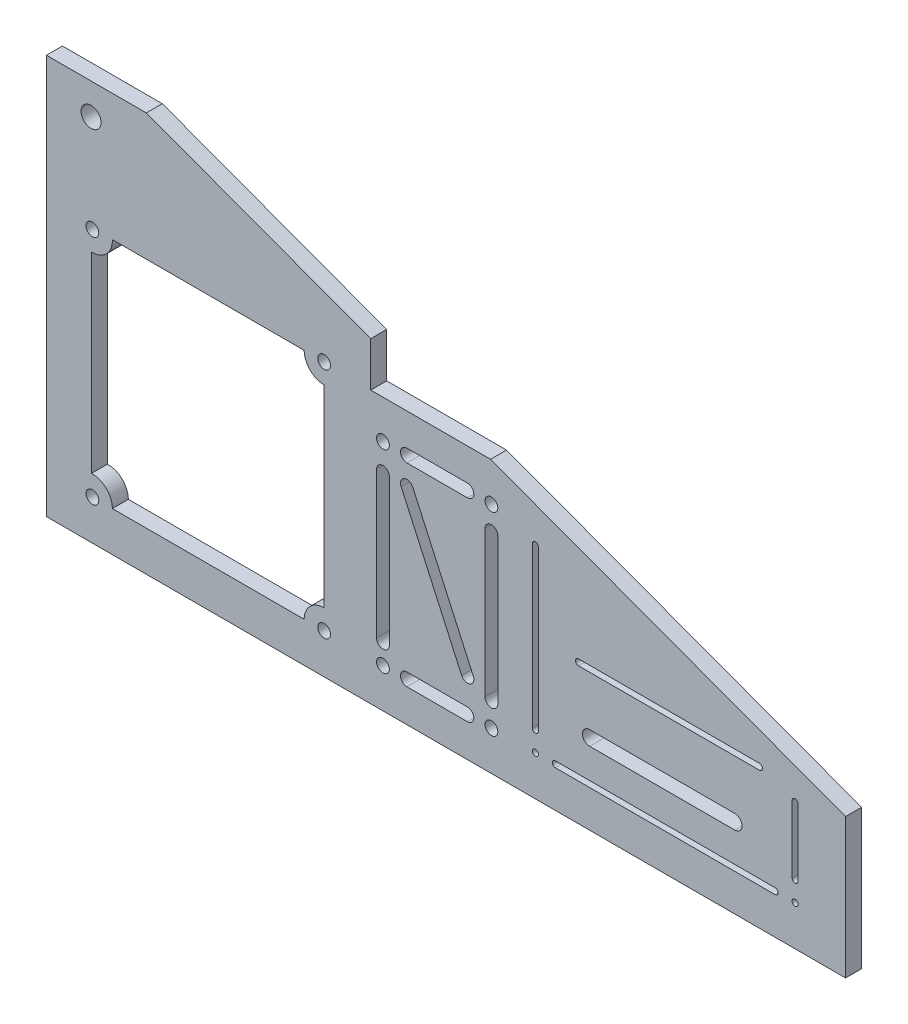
from build123d import *

# Parameters (mm, degrees)
SKETCH2_R           = 1.6
SKETCH2_R_2         = 0.75
SKETCH2_R_3         = 2.5
BOSS_EXTRUDE1_DEPTH = 4


with BuildPart() as part:
    # Sketch2 → Boss-Extrude1 (new body)
    with BuildSketch(Plane.XY):
        Polygon((0, 0), (0, 73.482722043), (0, 100), (25, 100), (81.153846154, 79.142857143), (81.153846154, 68), (111.153846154, 68), (200, 35), (200, 0), align=None)
        with Locations((11.5, 68)):
            Circle(SKETCH2_R, mode=Mode.SUBTRACT)
        with Locations((69.5, 68.289981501)):
            Circle(SKETCH2_R, mode=Mode.SUBTRACT)
        with Locations((69.5, 10)):
            Circle(SKETCH2_R, mode=Mode.SUBTRACT)
        with Locations((11.5, 10)):
            Circle(SKETCH2_R, mode=Mode.SUBTRACT)
        with Locations((122.360279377, 10)):
            Circle(SKETCH2_R_2, mode=Mode.SUBTRACT)
        with Locations((187.360279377, 10)):
            Circle(SKETCH2_R_2, mode=Mode.SUBTRACT)
        with Locations((11.166674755, 92.22083277)):
            Circle(SKETCH2_R_3, mode=Mode.SUBTRACT)
        with Locations((111.365794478, 9.831207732)):
            Circle(SKETCH2_R, mode=Mode.SUBTRACT)
        with Locations((84.215367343, 9.831207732)):
            Circle(SKETCH2_R, mode=Mode.SUBTRACT)
        with Locations((84.215367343, 58.3538112)):
            Circle(SKETCH2_R, mode=Mode.SUBTRACT)
        with Locations((111.365794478, 58.3538112)):
            Circle(SKETCH2_R, mode=Mode.SUBTRACT)
        with BuildLine():
            Line((11.243422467, 14.993412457), (11.243422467, 63.006587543))
            ThreePointArc((11.243422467, 63.006587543), (15.047341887, 64.476313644), (16.49158399, 68.289981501))
            Line((16.49158399, 68.289981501), (64.5, 68.289981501))
            ThreePointArc((64.5, 68.289981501), (65.964466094, 64.754447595), (69.5, 63.289981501))
            Line((69.5, 63.289981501), (69.5, 15))
            ThreePointArc((69.5, 15), (65.964466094, 13.535533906), (64.5, 10))
            Line((64.5, 10), (16.5, 10))
            ThreePointArc((16.5, 10), (14.943625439, 13.625112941), (11.243422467, 14.993412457))
        make_face(mode=Mode.SUBTRACT)
        with BuildLine():
            Line((127.360279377, 10.75), (182.360279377, 10.75))
            ThreePointArc((182.360279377, 10.75), (183.110279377, 10), (182.360279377, 9.25))
            Line((182.360279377, 9.25), (127.360279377, 9.25))
            ThreePointArc((127.360279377, 9.25), (126.610279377, 10), (127.360279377, 10.75))
        make_face(mode=Mode.SUBTRACT)
        with BuildLine():
            Line((121.610279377, 15), (121.610279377, 55))
            ThreePointArc((121.610279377, 55), (122.360279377, 55.75), (123.110279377, 55))
            Line((123.110279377, 55), (123.110279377, 15))
            ThreePointArc((123.110279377, 15), (122.360279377, 14.25), (121.610279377, 15))
        make_face(mode=Mode.SUBTRACT)
        with BuildLine():
            Line((186.610279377, 15), (186.610279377, 31.778644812))
            ThreePointArc((186.610279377, 31.778644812), (187.360279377, 32.528644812), (188.110279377, 31.778644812))
            Line((188.110279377, 31.778644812), (188.110279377, 15))
            ThreePointArc((188.110279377, 15), (187.360279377, 14.25), (186.610279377, 15))
        make_face(mode=Mode.SUBTRACT)
        with BuildLine():
            Line((135.938255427, 21.8), (172.280015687, 21.8))
            ThreePointArc((172.280015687, 21.8), (174.080015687, 20), (172.280015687, 18.2))
            Line((172.280015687, 18.2), (135.938255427, 18.2))
            ThreePointArc((135.938255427, 18.2), (134.138255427, 20), (135.938255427, 21.8))
        make_face(mode=Mode.SUBTRACT)
        with BuildLine():
            Line((90.215367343, 11.431207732), (105.365794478, 11.431207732))
            ThreePointArc((105.365794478, 11.431207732), (106.965794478, 9.831207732), (105.365794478, 8.231207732))
            Line((105.365794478, 8.231207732), (90.215367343, 8.231207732))
            ThreePointArc((90.215367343, 8.231207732), (88.615367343, 9.831207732), (90.215367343, 11.431207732))
        make_face(mode=Mode.SUBTRACT)
        with BuildLine():
            Line((82.615367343, 15), (82.615367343, 51.576676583))
            ThreePointArc((82.615367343, 51.576676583), (84.215367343, 53.176676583), (85.815367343, 51.576676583))
            Line((85.815367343, 51.576676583), (85.815367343, 15))
            ThreePointArc((85.815367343, 15), (84.215367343, 13.4), (82.615367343, 15))
        make_face(mode=Mode.SUBTRACT)
        with BuildLine():
            Line((109.765794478, 15.831207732), (109.765794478, 52.3538112))
            ThreePointArc((109.765794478, 52.3538112), (111.365794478, 53.9538112), (112.965794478, 52.3538112))
            Line((112.965794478, 52.3538112), (112.965794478, 15.831207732))
            ThreePointArc((112.965794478, 15.831207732), (111.365794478, 14.231207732), (109.765794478, 15.831207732))
        make_face(mode=Mode.SUBTRACT)
        with BuildLine():
            Line((105.365794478, 56.7538112), (90.215367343, 56.7538112))
            ThreePointArc((90.215367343, 56.7538112), (88.615367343, 58.3538112), (90.215367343, 59.9538112))
            Line((90.215367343, 59.9538112), (105.365794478, 59.9538112))
            ThreePointArc((105.365794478, 59.9538112), (106.965794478, 58.3538112), (105.365794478, 56.7538112))
        make_face(mode=Mode.SUBTRACT)
        with BuildLine():
            Line((91.672295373, 52.238009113), (106.822722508, 18.86133253))
            ThreePointArc((106.822722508, 18.86133253), (106.027127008, 16.74307197), (103.908866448, 17.53866747))
            Line((103.908866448, 17.53866747), (88.758439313, 50.915344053))
            ThreePointArc((88.758439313, 50.915344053), (89.554034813, 53.033604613), (91.672295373, 52.238009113))
        make_face(mode=Mode.SUBTRACT)
        with BuildLine():
            Line((133.149235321, 35.75), (178.445613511, 35.75))
            ThreePointArc((178.445613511, 35.75), (179.195613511, 35), (178.445613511, 34.25))
            Line((178.445613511, 34.25), (133.149235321, 34.25))
            ThreePointArc((133.149235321, 34.25), (132.399235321, 35), (133.149235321, 35.75))
        make_face(mode=Mode.SUBTRACT)
    extrude(amount=BOSS_EXTRUDE1_DEPTH)


solid = part.part
